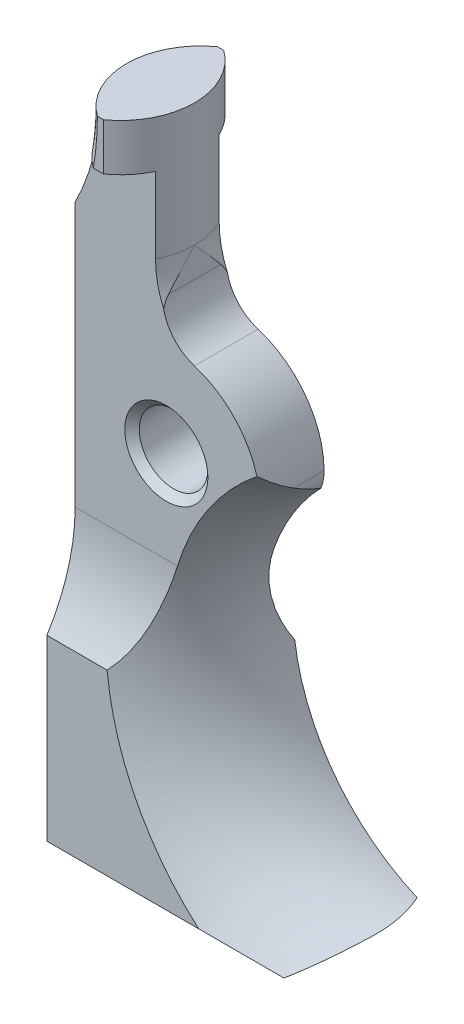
from build123d import *

# Parameters (mm, degrees)
SKETCH_1_R          = 1.20396
EXTRUDE_1_DEPTH     = 2.1082
CUT_EXTRUDE_1_DEPTH = 18.767084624
CUT_EXTRUDE_2_DEPTH = 5.9182
CHAMFER_1_SIZE      = 0.254


with BuildPart() as part:
    # Sketch 1 → Extrude 1 (new, symmetric)
    with BuildSketch(Plane.XY):
        with BuildLine():
            Line((-3.2004, 6.641029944), (-3.2004, -13.762280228))
            ThreePointArc((-3.2004, -13.762280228), (-2.095298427, -14.375597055), (-0.935300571, -14.877405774))
            ThreePointArc((-0.935300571, -14.877405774), (0.4572, -15.130148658), (1.849700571, -14.877405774))
            ThreePointArc((1.849700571, -14.877405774), (3.972515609, -13.84939078), (5.871721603, -12.450757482))
            ThreePointArc((5.871721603, -12.450757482), (1.44798597, -7.495152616), (2.927389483, -1.019133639))
            ThreePointArc((2.927389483, -1.019133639), (3.2062113, -0.537984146), (3.30198544, 0.009805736))
            ThreePointArc((3.30198544, 0.009805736), (2.657921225, 1.95924954), (0.986311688, 3.151252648))
            ThreePointArc((0.986311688, 3.151252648), (0.181256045, 3.726229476), (-0.127, 4.66627796))
            Line((-0.127, 4.66627796), (-0.127, 10.033))
            Line((-0.127, 10.033), (-2.5146, 10.033))
            ThreePointArc((-2.5146, 10.033), (-2.687767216, 8.302697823), (-3.2004, 6.641029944))
        make_face()
        Circle(SKETCH_1_R, mode=Mode.SUBTRACT)
    extrude(amount=EXTRUDE_1_DEPTH, both=True)

    # Sketch 2 → Cut-Extrude 1 (cut, through all)
    with BuildSketch(Plane.ZY.offset(3.2004)):
        with BuildLine():
            Line((1.1176, 8.382), (2.1082, 8.382))
            Line((2.1082, 8.382), (2.1082, -6.63575))
            ThreePointArc((2.1082, -6.63575), (1.370277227, -5.003429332), (1.1176, -3.229970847))
            Line((1.1176, -3.229970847), (1.1176, 8.382))
        make_face()
        with BuildLine():
            Line((-2.1082, -6.63575), (-2.1082, 8.382))
            Line((-2.1082, 8.382), (-1.1176, 8.382))
            Line((-1.1176, 8.382), (-1.1176, -3.229970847))
            ThreePointArc((-1.1176, -3.229970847), (-1.370277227, -5.003429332), (-2.1082, -6.63575))
        make_face()
    extrude(amount=-CUT_EXTRUDE_1_DEPTH, mode=Mode.SUBTRACT)

    # Sweep 1: sweep along a path in Sketch 4
    with BuildLine(Plane.XY) as sweep_1_path:
        ThreePointArc((-4.262963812, 4.791432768), (-2.963216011, 7.270265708), (-2.5146, 10.033))
    # Sketch 5 → Sweep 1 (sweep, cut)
    with BuildSketch(Plane(origin=(0, 10.033, 0), x_dir=(1, 0, 0), z_dir=(0, 1, 0))):
        with BuildLine():
            Line((-1.42970086, 2.1082), (-2.823358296, 2.1082))
            Line((-2.823358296, 2.1082), (-2.823358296, -2.1082))
            Line((-2.823358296, -2.1082), (-1.42970086, -2.1082))
            ThreePointArc((-1.42970086, -2.1082), (-2.5146, 0), (-1.42970086, 2.1082))
        make_face()
    sweep(path=sweep_1_path.line, mode=Mode.SUBTRACT)

    # Sweep 2: sweep along a path in Sketch 6
    with BuildLine(Plane.XY) as sweep_2_path:
        Line((-0.127, 10.033), (-0.127, 5.715))
        ThreePointArc((-0.127, 5.715), (0.009583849, 4.793776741), (0.407584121, 3.951812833))
    # Sketch 7 → Sweep 2 (sweep, cut)
    with BuildSketch(Plane(origin=(0, 10.033, 0), x_dir=(1, 0, 0), z_dir=(0, 1, 0))):
        with BuildLine():
            Line((-1.21189914, 2.1082), (0.725443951, 2.1082))
            Line((0.725443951, 2.1082), (0.725443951, -2.1082))
            Line((0.725443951, -2.1082), (-1.21189914, -2.1082))
            ThreePointArc((-1.21189914, -2.1082), (-0.127, 0), (-1.21189914, 2.1082))
        make_face()
    sweep(path=sweep_2_path.line, mode=Mode.SUBTRACT)

    # Sketch 8 → Cut-Extrude 2 (cut, symmetric)
    with BuildSketch(Plane(origin=(0, 0, 0), x_dir=(0, 0, -1), z_dir=(1, 0, 0))):
        with BuildLine():
            Line((-2.1082, -15.130148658), (0.4572, -15.130148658))
            ThreePointArc((0.4572, -15.130148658), (0.153445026, -15.069728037), (-0.104066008, -14.897664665))
            Line((-0.104066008, -14.897664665), (-2.1082, -12.893530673))
            Line((-2.1082, -12.893530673), (-2.1082, -15.130148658))
        make_face()
    extrude(amount=CUT_EXTRUDE_2_DEPTH, both=True, mode=Mode.SUBTRACT)

    # Sweep 3: sweep along a path in Sketch 9
    with BuildLine(Plane(origin=(0, 0, -2.1082), x_dir=(-1, 0, 0), z_dir=(0, 0, -1))) as sweep_3_path:
        ThreePointArc((-6.376168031, -11.977450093), (-4.266249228, -13.666733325), (-1.849700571, -14.877405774))
        ThreePointArc((-1.849700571, -14.877405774), (-0.4572, -15.130148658), (0.935300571, -14.877405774))
        ThreePointArc((0.935300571, -14.877405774), (2.095298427, -14.375597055), (3.2004, -13.762280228))
    # Sketch 10 → Sweep 3 (sweep, cut)
    with BuildSketch(Plane.ZY.offset(3.2004)):
        with BuildLine():
            Line((-2.1082, -13.423380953), (-2.1082, -13.762280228))
            Line((-2.1082, -13.762280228), (-0.4572, -13.762280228))
            ThreePointArc((-0.4572, -13.762280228), (-1.299911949, -13.676681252), (-2.1082, -13.423380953))
        make_face()
    sweep(path=sweep_3_path.line, mode=Mode.SUBTRACT)

    # Sweep 4: sweep along a path in Sketch 11
    with BuildLine(Plane.XY.offset(2.1082)) as sweep_4_path:
        ThreePointArc((8.4582, -12.9286), (1.325969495, -6.928312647), (6.01731476, 1.125471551))
    # Sketch 12 → Sweep 4 (sweep, cut)
    with BuildSketch(Plane(origin=(6.01731476, 1.125471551, 2.1082), x_dir=(0, 0, -1), z_dir=(0.9414382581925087, 0.33718541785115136, 0))):
        with BuildLine():
            Line((0, 0), (0, 2.354119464))
            ThreePointArc((0, 2.354119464), (1.8018655, 0.628392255), (4.2164, 0))
            Line((4.2164, 0), (0, 0))
        make_face()
    sweep(path=sweep_4_path.line, mode=Mode.SUBTRACT)

    # Chamfer 1
    chamfer_1_edges = [part.edges().sort_by_distance(p)[0] for p in [
        (-1.20396, 0, 1.1176),
        (-1.20396, 0, -1.1176),
    ]]
    chamfer(chamfer_1_edges, length=CHAMFER_1_SIZE)


solid = part.part
